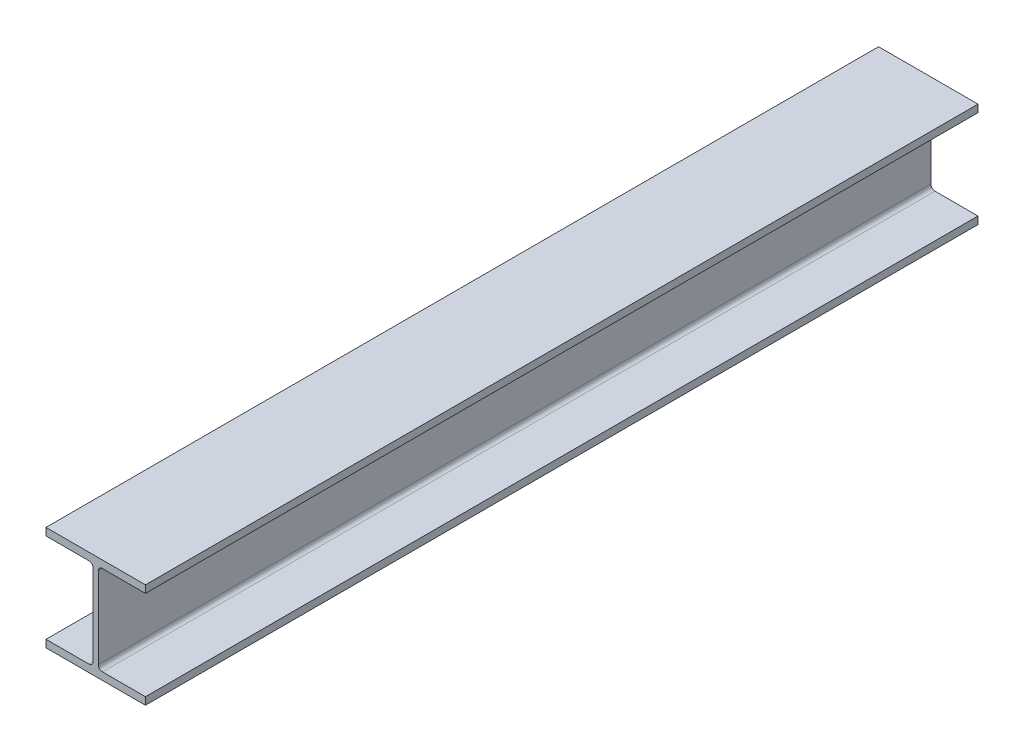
ISO-10303-21;
HEADER;
FILE_DESCRIPTION(('STEP AP214'),'2;1');
FILE_NAME('part.step','',(''),(''),'','','');
FILE_SCHEMA(('AUTOMOTIVE_DESIGN { 1 0 10303 214 1 1 1 1 }'));
ENDSEC;
DATA;
#1=APPLICATION_CONTEXT('core data for automotive mechanical design processes');
#2=APPLICATION_PROTOCOL_DEFINITION('international standard','automotive_design',2000,#1);
#3=PRODUCT_CONTEXT('',#1,'mechanical');
#4=PRODUCT('Part','Part','',(#3));
#5=PRODUCT_RELATED_PRODUCT_CATEGORY('part','',(#4));
#6=PRODUCT_DEFINITION_FORMATION('','',#4);
#7=PRODUCT_DEFINITION_CONTEXT('part definition',#1,'design');
#8=PRODUCT_DEFINITION('design','',#6,#7);
#9=PRODUCT_DEFINITION_SHAPE('','',#8);
#10=(LENGTH_UNIT() NAMED_UNIT(*) SI_UNIT(.MILLI.,.METRE.));
#11=(NAMED_UNIT(*) PLANE_ANGLE_UNIT() SI_UNIT($,.RADIAN.));
#12=(NAMED_UNIT(*) SI_UNIT($,.STERADIAN.) SOLID_ANGLE_UNIT());
#13=UNCERTAINTY_MEASURE_WITH_UNIT(LENGTH_MEASURE(1.E-05),#10,'distance_accuracy_value','');
#14=(GEOMETRIC_REPRESENTATION_CONTEXT(3) GLOBAL_UNCERTAINTY_ASSIGNED_CONTEXT((#13)) GLOBAL_UNIT_ASSIGNED_CONTEXT((#10,
#11,#12)) REPRESENTATION_CONTEXT('',''));
#15=CARTESIAN_POINT('',(0.,0.,0.));
#16=DIRECTION('',(0.,0.,1.));
#17=DIRECTION('',(1.,0.,0.));
#18=AXIS2_PLACEMENT_3D('',#15,#16,#17);
#19=CARTESIAN_POINT('',(154.432,0.,-646.51128));
#20=DIRECTION('',(0.,-1.,0.));
#21=DIRECTION('',(0.,0.,-1.));
#22=AXIS2_PLACEMENT_3D('',#19,#20,#21);
#23=PLANE('',#22);
#24=DIRECTION('',(1.,0.,0.));
#25=VECTOR('',#24,1.);
#26=CARTESIAN_POINT('',(154.432,0.,646.51128));
#27=LINE('',#26,#25);
#28=CARTESIAN_POINT('',(0.,0.,646.51128));
#29=VERTEX_POINT('',#28);
#30=CARTESIAN_POINT('',(154.432,0.,646.51128));
#31=VERTEX_POINT('',#30);
#32=EDGE_CURVE('E178',#29,#31,#27,.T.);
#33=ORIENTED_EDGE('',*,*,#32,.F.);
#34=DIRECTION('',(0.,0.,1.));
#35=VECTOR('',#34,1.);
#36=CARTESIAN_POINT('',(0.,0.,-646.51128));
#37=LINE('',#36,#35);
#38=CARTESIAN_POINT('',(0.,0.,-646.51128));
#39=VERTEX_POINT('',#38);
#40=EDGE_CURVE('E11',#39,#29,#37,.T.);
#41=ORIENTED_EDGE('',*,*,#40,.F.);
#42=DIRECTION('',(1.,0.,0.));
#43=VECTOR('',#42,1.);
#44=CARTESIAN_POINT('',(154.432,0.,-646.51128));
#45=LINE('',#44,#43);
#46=CARTESIAN_POINT('',(154.432,0.,-646.51128));
#47=VERTEX_POINT('',#46);
#48=EDGE_CURVE('E222',#39,#47,#45,.T.);
#49=ORIENTED_EDGE('',*,*,#48,.T.);
#50=DIRECTION('',(0.,0.,1.));
#51=VECTOR('',#50,1.);
#52=CARTESIAN_POINT('',(154.432,0.,-646.51128));
#53=LINE('',#52,#51);
#54=EDGE_CURVE('E36',#47,#31,#53,.T.);
#55=ORIENTED_EDGE('',*,*,#54,.T.);
#56=EDGE_LOOP('',(#33,#41,#49,#55));
#57=FACE_BOUND('',#56,.T.);
#58=ADVANCED_FACE('F33',(#57),#23,.T.);
#59=CARTESIAN_POINT('',(0.,0.,-646.51128));
#60=DIRECTION('',(-1.,0.,0.));
#61=DIRECTION('',(0.,-1.,0.));
#62=AXIS2_PLACEMENT_3D('',#59,#60,#61);
#63=PLANE('',#62);
#64=DIRECTION('',(0.,-1.,0.));
#65=VECTOR('',#64,1.);
#66=CARTESIAN_POINT('',(0.,0.,646.51128));
#67=LINE('',#66,#65);
#68=CARTESIAN_POINT('',(0.,11.557,646.51128));
#69=VERTEX_POINT('',#68);
#70=EDGE_CURVE('E220',#69,#29,#67,.T.);
#71=ORIENTED_EDGE('',*,*,#70,.F.);
#72=DIRECTION('',(0.,0.,1.));
#73=VECTOR('',#72,1.);
#74=CARTESIAN_POINT('',(0.,11.557,-646.51128));
#75=LINE('',#74,#73);
#76=CARTESIAN_POINT('',(0.,11.557,-646.51128));
#77=VERTEX_POINT('',#76);
#78=EDGE_CURVE('E42',#77,#69,#75,.T.);
#79=ORIENTED_EDGE('',*,*,#78,.F.);
#80=DIRECTION('',(0.,-1.,0.));
#81=VECTOR('',#80,1.);
#82=CARTESIAN_POINT('',(0.,0.,-646.51128));
#83=LINE('',#82,#81);
#84=EDGE_CURVE('E168',#77,#39,#83,.T.);
#85=ORIENTED_EDGE('',*,*,#84,.T.);
#86=ORIENTED_EDGE('',*,*,#40,.T.);
#87=EDGE_LOOP('',(#71,#79,#85,#86));
#88=FACE_BOUND('',#87,.T.);
#89=ADVANCED_FACE('F250',(#88),#63,.T.);
#90=CARTESIAN_POINT('',(0.,11.557,-646.51128));
#91=DIRECTION('',(0.,1.,0.));
#92=DIRECTION('',(-1.,0.,0.));
#93=AXIS2_PLACEMENT_3D('',#90,#91,#92);
#94=PLANE('',#93);
#95=DIRECTION('',(-1.,0.,0.));
#96=VECTOR('',#95,1.);
#97=CARTESIAN_POINT('',(0.,11.557,646.51128));
#98=LINE('',#97,#96);
#99=CARTESIAN_POINT('',(66.802,11.557,646.51128));
#100=VERTEX_POINT('',#99);
#101=EDGE_CURVE('E155',#100,#69,#98,.T.);
#102=ORIENTED_EDGE('',*,*,#101,.F.);
#103=DIRECTION('',(0.,0.,1.));
#104=VECTOR('',#103,1.);
#105=CARTESIAN_POINT('',(66.802,11.557,-646.51128));
#106=LINE('',#105,#104);
#107=CARTESIAN_POINT('',(66.802,11.557,-646.51128));
#108=VERTEX_POINT('',#107);
#109=EDGE_CURVE('E150',#108,#100,#106,.T.);
#110=ORIENTED_EDGE('',*,*,#109,.F.);
#111=DIRECTION('',(-1.,0.,0.));
#112=VECTOR('',#111,1.);
#113=CARTESIAN_POINT('',(0.,11.557,-646.51128));
#114=LINE('',#113,#112);
#115=EDGE_CURVE('E153',#108,#77,#114,.T.);
#116=ORIENTED_EDGE('',*,*,#115,.T.);
#117=ORIENTED_EDGE('',*,*,#78,.T.);
#118=EDGE_LOOP('',(#102,#110,#116,#117));
#119=FACE_BOUND('',#118,.T.);
#120=ADVANCED_FACE('F152',(#119),#94,.T.);
#121=CARTESIAN_POINT('',(66.802,17.907,-646.51128));
#122=DIRECTION('',(0.,0.,1.));
#123=DIRECTION('',(1.,0.,0.));
#124=AXIS2_PLACEMENT_3D('',#121,#122,#123);
#125=CYLINDRICAL_SURFACE('',#124,6.35);
#126=CARTESIAN_POINT('',(66.802,17.907,646.51128));
#127=DIRECTION('',(0.,0.,-1.));
#128=DIRECTION('',(1.,0.,0.));
#129=AXIS2_PLACEMENT_3D('',#126,#127,#128);
#130=CIRCLE('',#129,6.35);
#131=CARTESIAN_POINT('',(73.152,17.907,646.51128));
#132=VERTEX_POINT('',#131);
#133=EDGE_CURVE('E217',#132,#100,#130,.T.);
#134=ORIENTED_EDGE('',*,*,#133,.F.);
#135=DIRECTION('',(0.,0.,1.));
#136=VECTOR('',#135,1.);
#137=CARTESIAN_POINT('',(73.152,17.907,-646.51128));
#138=LINE('',#137,#136);
#139=CARTESIAN_POINT('',(73.152,17.907,-646.51128));
#140=VERTEX_POINT('',#139);
#141=EDGE_CURVE('E160',#140,#132,#138,.T.);
#142=ORIENTED_EDGE('',*,*,#141,.F.);
#143=CARTESIAN_POINT('',(66.802,17.907,-646.51128));
#144=DIRECTION('',(0.,0.,-1.));
#145=DIRECTION('',(1.,0.,0.));
#146=AXIS2_PLACEMENT_3D('',#143,#144,#145);
#147=CIRCLE('',#146,6.35);
#148=EDGE_CURVE('E166',#140,#108,#147,.T.);
#149=ORIENTED_EDGE('',*,*,#148,.T.);
#150=ORIENTED_EDGE('',*,*,#109,.T.);
#151=EDGE_LOOP('',(#134,#142,#149,#150));
#152=FACE_BOUND('',#151,.T.);
#153=ADVANCED_FACE('F170',(#152),#125,.F.);
#154=CARTESIAN_POINT('',(73.152,17.907,-646.51128));
#155=DIRECTION('',(-1.,0.,0.));
#156=DIRECTION('',(0.,-1.,0.));
#157=AXIS2_PLACEMENT_3D('',#154,#155,#156);
#158=PLANE('',#157);
#159=DIRECTION('',(0.,-1.,0.));
#160=VECTOR('',#159,1.);
#161=CARTESIAN_POINT('',(73.152,17.907,646.51128));
#162=LINE('',#161,#160);
#163=CARTESIAN_POINT('',(73.152,144.145,646.51128));
#164=VERTEX_POINT('',#163);
#165=EDGE_CURVE('E214',#164,#132,#162,.T.);
#166=ORIENTED_EDGE('',*,*,#165,.F.);
#167=DIRECTION('',(0.,0.,1.));
#168=VECTOR('',#167,1.);
#169=CARTESIAN_POINT('',(73.152,144.145,-646.51128));
#170=LINE('',#169,#168);
#171=CARTESIAN_POINT('',(73.152,144.145,-646.51128));
#172=VERTEX_POINT('',#171);
#173=EDGE_CURVE('E226',#172,#164,#170,.T.);
#174=ORIENTED_EDGE('',*,*,#173,.F.);
#175=DIRECTION('',(0.,-1.,0.));
#176=VECTOR('',#175,1.);
#177=CARTESIAN_POINT('',(73.152,17.907,-646.51128));
#178=LINE('',#177,#176);
#179=EDGE_CURVE('E171',#172,#140,#178,.T.);
#180=ORIENTED_EDGE('',*,*,#179,.T.);
#181=ORIENTED_EDGE('',*,*,#141,.T.);
#182=EDGE_LOOP('',(#166,#174,#180,#181));
#183=FACE_BOUND('',#182,.T.);
#184=ADVANCED_FACE('F263',(#183),#158,.T.);
#185=CARTESIAN_POINT('',(66.802,144.145,-646.51128));
#186=DIRECTION('',(0.,0.,1.));
#187=DIRECTION('',(1.,0.,0.));
#188=AXIS2_PLACEMENT_3D('',#185,#186,#187);
#189=CYLINDRICAL_SURFACE('',#188,6.34999999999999);
#190=CARTESIAN_POINT('',(66.802,144.145,646.51128));
#191=DIRECTION('',(0.,0.,-1.));
#192=DIRECTION('',(1.,0.,0.));
#193=AXIS2_PLACEMENT_3D('',#190,#191,#192);
#194=CIRCLE('',#193,6.34999999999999);
#195=CARTESIAN_POINT('',(66.802,150.495,646.51128));
#196=VERTEX_POINT('',#195);
#197=EDGE_CURVE('E211',#196,#164,#194,.T.);
#198=ORIENTED_EDGE('',*,*,#197,.F.);
#199=DIRECTION('',(0.,0.,1.));
#200=VECTOR('',#199,1.);
#201=CARTESIAN_POINT('',(66.802,150.495,-646.51128));
#202=LINE('',#201,#200);
#203=CARTESIAN_POINT('',(66.802,150.495,-646.51128));
#204=VERTEX_POINT('',#203);
#205=EDGE_CURVE('E228',#204,#196,#202,.T.);
#206=ORIENTED_EDGE('',*,*,#205,.F.);
#207=CARTESIAN_POINT('',(66.802,144.145,-646.51128));
#208=DIRECTION('',(0.,0.,-1.));
#209=DIRECTION('',(1.,0.,0.));
#210=AXIS2_PLACEMENT_3D('',#207,#208,#209);
#211=CIRCLE('',#210,6.34999999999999);
#212=EDGE_CURVE('E173',#204,#172,#211,.T.);
#213=ORIENTED_EDGE('',*,*,#212,.T.);
#214=ORIENTED_EDGE('',*,*,#173,.T.);
#215=EDGE_LOOP('',(#198,#206,#213,#214));
#216=FACE_BOUND('',#215,.T.);
#217=ADVANCED_FACE('F266',(#216),#189,.F.);
#218=CARTESIAN_POINT('',(66.802,150.495,-646.51128));
#219=DIRECTION('',(0.,-1.,0.));
#220=DIRECTION('',(0.,0.,-1.));
#221=AXIS2_PLACEMENT_3D('',#218,#219,#220);
#222=PLANE('',#221);
#223=DIRECTION('',(1.,0.,0.));
#224=VECTOR('',#223,1.);
#225=CARTESIAN_POINT('',(66.802,150.495,646.51128));
#226=LINE('',#225,#224);
#227=CARTESIAN_POINT('',(0.,150.495,646.51128));
#228=VERTEX_POINT('',#227);
#229=EDGE_CURVE('E208',#228,#196,#226,.T.);
#230=ORIENTED_EDGE('',*,*,#229,.F.);
#231=DIRECTION('',(0.,0.,1.));
#232=VECTOR('',#231,1.);
#233=CARTESIAN_POINT('',(0.,150.495,-646.51128));
#234=LINE('',#233,#232);
#235=CARTESIAN_POINT('',(0.,150.495,-646.51128));
#236=VERTEX_POINT('',#235);
#237=EDGE_CURVE('E230',#236,#228,#234,.T.);
#238=ORIENTED_EDGE('',*,*,#237,.F.);
#239=DIRECTION('',(1.,0.,0.));
#240=VECTOR('',#239,1.);
#241=CARTESIAN_POINT('',(66.802,150.495,-646.51128));
#242=LINE('',#241,#240);
#243=EDGE_CURVE('E447',#236,#204,#242,.T.);
#244=ORIENTED_EDGE('',*,*,#243,.T.);
#245=ORIENTED_EDGE('',*,*,#205,.T.);
#246=EDGE_LOOP('',(#230,#238,#244,#245));
#247=FACE_BOUND('',#246,.T.);
#248=ADVANCED_FACE('F270',(#247),#222,.T.);
#249=CARTESIAN_POINT('',(0.,150.495,-646.51128));
#250=DIRECTION('',(-1.,0.,0.));
#251=DIRECTION('',(0.,-1.,0.));
#252=AXIS2_PLACEMENT_3D('',#249,#250,#251);
#253=PLANE('',#252);
#254=DIRECTION('',(0.,-1.,0.));
#255=VECTOR('',#254,1.);
#256=CARTESIAN_POINT('',(0.,150.495,646.51128));
#257=LINE('',#256,#255);
#258=CARTESIAN_POINT('',(0.,162.052,646.51128));
#259=VERTEX_POINT('',#258);
#260=EDGE_CURVE('E205',#259,#228,#257,.T.);
#261=ORIENTED_EDGE('',*,*,#260,.F.);
#262=DIRECTION('',(0.,0.,1.));
#263=VECTOR('',#262,1.);
#264=CARTESIAN_POINT('',(0.,162.052,-646.51128));
#265=LINE('',#264,#263);
#266=CARTESIAN_POINT('',(0.,162.052,-646.51128));
#267=VERTEX_POINT('',#266);
#268=EDGE_CURVE('E232',#267,#259,#265,.T.);
#269=ORIENTED_EDGE('',*,*,#268,.F.);
#270=DIRECTION('',(0.,-1.,0.));
#271=VECTOR('',#270,1.);
#272=CARTESIAN_POINT('',(0.,150.495,-646.51128));
#273=LINE('',#272,#271);
#274=EDGE_CURVE('E443',#267,#236,#273,.T.);
#275=ORIENTED_EDGE('',*,*,#274,.T.);
#276=ORIENTED_EDGE('',*,*,#237,.T.);
#277=EDGE_LOOP('',(#261,#269,#275,#276));
#278=FACE_BOUND('',#277,.T.);
#279=ADVANCED_FACE('F274',(#278),#253,.T.);
#280=CARTESIAN_POINT('',(0.,162.052,-646.51128));
#281=DIRECTION('',(0.,1.,0.));
#282=DIRECTION('',(0.,0.,1.));
#283=AXIS2_PLACEMENT_3D('',#280,#281,#282);
#284=PLANE('',#283);
#285=DIRECTION('',(-1.,0.,0.));
#286=VECTOR('',#285,1.);
#287=CARTESIAN_POINT('',(0.,162.052,646.51128));
#288=LINE('',#287,#286);
#289=CARTESIAN_POINT('',(154.432,162.052,646.51128));
#290=VERTEX_POINT('',#289);
#291=EDGE_CURVE('E202',#290,#259,#288,.T.);
#292=ORIENTED_EDGE('',*,*,#291,.F.);
#293=DIRECTION('',(0.,0.,1.));
#294=VECTOR('',#293,1.);
#295=CARTESIAN_POINT('',(154.432,162.052,-646.51128));
#296=LINE('',#295,#294);
#297=CARTESIAN_POINT('',(154.432,162.052,-646.51128));
#298=VERTEX_POINT('',#297);
#299=EDGE_CURVE('E234',#298,#290,#296,.T.);
#300=ORIENTED_EDGE('',*,*,#299,.F.);
#301=DIRECTION('',(-1.,0.,0.));
#302=VECTOR('',#301,1.);
#303=CARTESIAN_POINT('',(0.,162.052,-646.51128));
#304=LINE('',#303,#302);
#305=EDGE_CURVE('E454',#298,#267,#304,.T.);
#306=ORIENTED_EDGE('',*,*,#305,.T.);
#307=ORIENTED_EDGE('',*,*,#268,.T.);
#308=EDGE_LOOP('',(#292,#300,#306,#307));
#309=FACE_BOUND('',#308,.T.);
#310=ADVANCED_FACE('F278',(#309),#284,.T.);
#311=CARTESIAN_POINT('',(154.432,162.052,-646.51128));
#312=DIRECTION('',(1.,0.,0.));
#313=DIRECTION('',(0.,0.,-1.));
#314=AXIS2_PLACEMENT_3D('',#311,#312,#313);
#315=PLANE('',#314);
#316=DIRECTION('',(0.,1.,0.));
#317=VECTOR('',#316,1.);
#318=CARTESIAN_POINT('',(154.432,162.052,646.51128));
#319=LINE('',#318,#317);
#320=CARTESIAN_POINT('',(154.432,150.495,646.51128));
#321=VERTEX_POINT('',#320);
#322=EDGE_CURVE('E199',#321,#290,#319,.T.);
#323=ORIENTED_EDGE('',*,*,#322,.F.);
#324=DIRECTION('',(0.,0.,1.));
#325=VECTOR('',#324,1.);
#326=CARTESIAN_POINT('',(154.432,150.495,-646.51128));
#327=LINE('',#326,#325);
#328=CARTESIAN_POINT('',(154.432,150.495,-646.51128));
#329=VERTEX_POINT('',#328);
#330=EDGE_CURVE('E236',#329,#321,#327,.T.);
#331=ORIENTED_EDGE('',*,*,#330,.F.);
#332=DIRECTION('',(0.,1.,0.));
#333=VECTOR('',#332,1.);
#334=CARTESIAN_POINT('',(154.432,162.052,-646.51128));
#335=LINE('',#334,#333);
#336=EDGE_CURVE('E436',#329,#298,#335,.T.);
#337=ORIENTED_EDGE('',*,*,#336,.T.);
#338=ORIENTED_EDGE('',*,*,#299,.T.);
#339=EDGE_LOOP('',(#323,#331,#337,#338));
#340=FACE_BOUND('',#339,.T.);
#341=ADVANCED_FACE('F282',(#340),#315,.T.);
#342=CARTESIAN_POINT('',(154.432,150.495,-646.51128));
#343=DIRECTION('',(0.,-1.,0.));
#344=DIRECTION('',(0.,0.,-1.));
#345=AXIS2_PLACEMENT_3D('',#342,#343,#344);
#346=PLANE('',#345);
#347=DIRECTION('',(1.,0.,0.));
#348=VECTOR('',#347,1.);
#349=CARTESIAN_POINT('',(154.432,150.495,646.51128));
#350=LINE('',#349,#348);
#351=CARTESIAN_POINT('',(87.63,150.495,646.51128));
#352=VERTEX_POINT('',#351);
#353=EDGE_CURVE('E196',#352,#321,#350,.T.);
#354=ORIENTED_EDGE('',*,*,#353,.F.);
#355=DIRECTION('',(0.,0.,1.));
#356=VECTOR('',#355,1.);
#357=CARTESIAN_POINT('',(87.63,150.495,-646.51128));
#358=LINE('',#357,#356);
#359=CARTESIAN_POINT('',(87.63,150.495,-646.51128));
#360=VERTEX_POINT('',#359);
#361=EDGE_CURVE('E238',#360,#352,#358,.T.);
#362=ORIENTED_EDGE('',*,*,#361,.F.);
#363=DIRECTION('',(1.,0.,0.));
#364=VECTOR('',#363,1.);
#365=CARTESIAN_POINT('',(154.432,150.495,-646.51128));
#366=LINE('',#365,#364);
#367=EDGE_CURVE('E432',#360,#329,#366,.T.);
#368=ORIENTED_EDGE('',*,*,#367,.T.);
#369=ORIENTED_EDGE('',*,*,#330,.T.);
#370=EDGE_LOOP('',(#354,#362,#368,#369));
#371=FACE_BOUND('',#370,.T.);
#372=ADVANCED_FACE('F286',(#371),#346,.T.);
#373=CARTESIAN_POINT('',(87.63,144.145,-646.51128));
#374=DIRECTION('',(0.,0.,1.));
#375=DIRECTION('',(1.,0.,0.));
#376=AXIS2_PLACEMENT_3D('',#373,#374,#375);
#377=CYLINDRICAL_SURFACE('',#376,6.34999999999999);
#378=CARTESIAN_POINT('',(87.63,144.145,646.51128));
#379=DIRECTION('',(0.,0.,-1.));
#380=DIRECTION('',(1.,0.,0.));
#381=AXIS2_PLACEMENT_3D('',#378,#379,#380);
#382=CIRCLE('',#381,6.34999999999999);
#383=CARTESIAN_POINT('',(81.28,144.145,646.51128));
#384=VERTEX_POINT('',#383);
#385=EDGE_CURVE('E193',#384,#352,#382,.T.);
#386=ORIENTED_EDGE('',*,*,#385,.F.);
#387=DIRECTION('',(0.,0.,1.));
#388=VECTOR('',#387,1.);
#389=CARTESIAN_POINT('',(81.28,144.145,-646.51128));
#390=LINE('',#389,#388);
#391=CARTESIAN_POINT('',(81.28,144.145,-646.51128));
#392=VERTEX_POINT('',#391);
#393=EDGE_CURVE('E240',#392,#384,#390,.T.);
#394=ORIENTED_EDGE('',*,*,#393,.F.);
#395=CARTESIAN_POINT('',(87.63,144.145,-646.51128));
#396=DIRECTION('',(0.,0.,-1.));
#397=DIRECTION('',(1.,0.,0.));
#398=AXIS2_PLACEMENT_3D('',#395,#396,#397);
#399=CIRCLE('',#398,6.34999999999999);
#400=EDGE_CURVE('E458',#392,#360,#399,.T.);
#401=ORIENTED_EDGE('',*,*,#400,.T.);
#402=ORIENTED_EDGE('',*,*,#361,.T.);
#403=EDGE_LOOP('',(#386,#394,#401,#402));
#404=FACE_BOUND('',#403,.T.);
#405=ADVANCED_FACE('F290',(#404),#377,.F.);
#406=CARTESIAN_POINT('',(81.28,144.145,-646.51128));
#407=DIRECTION('',(1.,0.,0.));
#408=DIRECTION('',(0.,1.,0.));
#409=AXIS2_PLACEMENT_3D('',#406,#407,#408);
#410=PLANE('',#409);
#411=DIRECTION('',(0.,1.,0.));
#412=VECTOR('',#411,1.);
#413=CARTESIAN_POINT('',(81.28,144.145,646.51128));
#414=LINE('',#413,#412);
#415=CARTESIAN_POINT('',(81.28,17.907,646.51128));
#416=VERTEX_POINT('',#415);
#417=EDGE_CURVE('E190',#416,#384,#414,.T.);
#418=ORIENTED_EDGE('',*,*,#417,.F.);
#419=DIRECTION('',(0.,0.,1.));
#420=VECTOR('',#419,1.);
#421=CARTESIAN_POINT('',(81.28,17.907,-646.51128));
#422=LINE('',#421,#420);
#423=CARTESIAN_POINT('',(81.28,17.907,-646.51128));
#424=VERTEX_POINT('',#423);
#425=EDGE_CURVE('E242',#424,#416,#422,.T.);
#426=ORIENTED_EDGE('',*,*,#425,.F.);
#427=DIRECTION('',(0.,1.,0.));
#428=VECTOR('',#427,1.);
#429=CARTESIAN_POINT('',(81.28,144.145,-646.51128));
#430=LINE('',#429,#428);
#431=EDGE_CURVE('E425',#424,#392,#430,.T.);
#432=ORIENTED_EDGE('',*,*,#431,.T.);
#433=ORIENTED_EDGE('',*,*,#393,.T.);
#434=EDGE_LOOP('',(#418,#426,#432,#433));
#435=FACE_BOUND('',#434,.T.);
#436=ADVANCED_FACE('F294',(#435),#410,.T.);
#437=CARTESIAN_POINT('',(87.63,17.907,-646.51128));
#438=DIRECTION('',(0.,0.,1.));
#439=DIRECTION('',(1.,0.,0.));
#440=AXIS2_PLACEMENT_3D('',#437,#438,#439);
#441=CYLINDRICAL_SURFACE('',#440,6.34999999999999);
#442=CARTESIAN_POINT('',(87.63,17.907,646.51128));
#443=DIRECTION('',(0.,0.,-1.));
#444=DIRECTION('',(1.,0.,0.));
#445=AXIS2_PLACEMENT_3D('',#442,#443,#444);
#446=CIRCLE('',#445,6.34999999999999);
#447=CARTESIAN_POINT('',(87.63,11.557,646.51128));
#448=VERTEX_POINT('',#447);
#449=EDGE_CURVE('E187',#448,#416,#446,.T.);
#450=ORIENTED_EDGE('',*,*,#449,.F.);
#451=DIRECTION('',(0.,0.,1.));
#452=VECTOR('',#451,1.);
#453=CARTESIAN_POINT('',(87.63,11.557,-646.51128));
#454=LINE('',#453,#452);
#455=CARTESIAN_POINT('',(87.63,11.557,-646.51128));
#456=VERTEX_POINT('',#455);
#457=EDGE_CURVE('E244',#456,#448,#454,.T.);
#458=ORIENTED_EDGE('',*,*,#457,.F.);
#459=CARTESIAN_POINT('',(87.63,17.907,-646.51128));
#460=DIRECTION('',(0.,0.,-1.));
#461=DIRECTION('',(1.,0.,0.));
#462=AXIS2_PLACEMENT_3D('',#459,#460,#461);
#463=CIRCLE('',#462,6.34999999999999);
#464=EDGE_CURVE('E421',#456,#424,#463,.T.);
#465=ORIENTED_EDGE('',*,*,#464,.T.);
#466=ORIENTED_EDGE('',*,*,#425,.T.);
#467=EDGE_LOOP('',(#450,#458,#465,#466));
#468=FACE_BOUND('',#467,.T.);
#469=ADVANCED_FACE('F298',(#468),#441,.F.);
#470=CARTESIAN_POINT('',(87.63,11.557,-646.51128));
#471=DIRECTION('',(0.,1.,0.));
#472=DIRECTION('',(-1.,0.,0.));
#473=AXIS2_PLACEMENT_3D('',#470,#471,#472);
#474=PLANE('',#473);
#475=DIRECTION('',(-1.,0.,0.));
#476=VECTOR('',#475,1.);
#477=CARTESIAN_POINT('',(87.63,11.557,646.51128));
#478=LINE('',#477,#476);
#479=CARTESIAN_POINT('',(154.432,11.557,646.51128));
#480=VERTEX_POINT('',#479);
#481=EDGE_CURVE('E184',#480,#448,#478,.T.);
#482=ORIENTED_EDGE('',*,*,#481,.F.);
#483=DIRECTION('',(0.,0.,1.));
#484=VECTOR('',#483,1.);
#485=CARTESIAN_POINT('',(154.432,11.557,-646.51128));
#486=LINE('',#485,#484);
#487=CARTESIAN_POINT('',(154.432,11.557,-646.51128));
#488=VERTEX_POINT('',#487);
#489=EDGE_CURVE('E245',#488,#480,#486,.T.);
#490=ORIENTED_EDGE('',*,*,#489,.F.);
#491=DIRECTION('',(-1.,0.,0.));
#492=VECTOR('',#491,1.);
#493=CARTESIAN_POINT('',(87.63,11.557,-646.51128));
#494=LINE('',#493,#492);
#495=EDGE_CURVE('E462',#488,#456,#494,.T.);
#496=ORIENTED_EDGE('',*,*,#495,.T.);
#497=ORIENTED_EDGE('',*,*,#457,.T.);
#498=EDGE_LOOP('',(#482,#490,#496,#497));
#499=FACE_BOUND('',#498,.T.);
#500=ADVANCED_FACE('F302',(#499),#474,.T.);
#501=CARTESIAN_POINT('',(154.432,11.557,-646.51128));
#502=DIRECTION('',(1.,0.,0.));
#503=DIRECTION('',(0.,0.,-1.));
#504=AXIS2_PLACEMENT_3D('',#501,#502,#503);
#505=PLANE('',#504);
#506=DIRECTION('',(0.,1.,0.));
#507=VECTOR('',#506,1.);
#508=CARTESIAN_POINT('',(154.432,11.557,646.51128));
#509=LINE('',#508,#507);
#510=EDGE_CURVE('E181',#31,#480,#509,.T.);
#511=ORIENTED_EDGE('',*,*,#510,.F.);
#512=ORIENTED_EDGE('',*,*,#54,.F.);
#513=DIRECTION('',(0.,1.,0.));
#514=VECTOR('',#513,1.);
#515=CARTESIAN_POINT('',(154.432,11.557,-646.51128));
#516=LINE('',#515,#514);
#517=EDGE_CURVE('E464',#47,#488,#516,.T.);
#518=ORIENTED_EDGE('',*,*,#517,.T.);
#519=ORIENTED_EDGE('',*,*,#489,.T.);
#520=EDGE_LOOP('',(#511,#512,#518,#519));
#521=FACE_BOUND('',#520,.T.);
#522=ADVANCED_FACE('F247',(#521),#505,.T.);
#523=CARTESIAN_POINT('',(66.802,17.907,-646.51128));
#524=DIRECTION('',(0.,0.,1.));
#525=DIRECTION('',(1.,0.,0.));
#526=AXIS2_PLACEMENT_3D('',#523,#524,#525);
#527=PLANE('',#526);
#528=ORIENTED_EDGE('',*,*,#48,.F.);
#529=ORIENTED_EDGE('',*,*,#84,.F.);
#530=ORIENTED_EDGE('',*,*,#115,.F.);
#531=ORIENTED_EDGE('',*,*,#148,.F.);
#532=ORIENTED_EDGE('',*,*,#179,.F.);
#533=ORIENTED_EDGE('',*,*,#212,.F.);
#534=ORIENTED_EDGE('',*,*,#243,.F.);
#535=ORIENTED_EDGE('',*,*,#274,.F.);
#536=ORIENTED_EDGE('',*,*,#305,.F.);
#537=ORIENTED_EDGE('',*,*,#336,.F.);
#538=ORIENTED_EDGE('',*,*,#367,.F.);
#539=ORIENTED_EDGE('',*,*,#400,.F.);
#540=ORIENTED_EDGE('',*,*,#431,.F.);
#541=ORIENTED_EDGE('',*,*,#464,.F.);
#542=ORIENTED_EDGE('',*,*,#495,.F.);
#543=ORIENTED_EDGE('',*,*,#517,.F.);
#544=EDGE_LOOP('',(#528,#529,#530,#531,#532,#533,#534,#535,#536,#537,#538,#539,#540,#541,#542,#543));
#545=FACE_BOUND('',#544,.T.);
#546=ADVANCED_FACE('F164',(#545),#527,.F.);
#547=CARTESIAN_POINT('',(66.802,17.907,646.51128));
#548=DIRECTION('',(0.,0.,1.));
#549=DIRECTION('',(1.,0.,0.));
#550=AXIS2_PLACEMENT_3D('',#547,#548,#549);
#551=PLANE('',#550);
#552=ORIENTED_EDGE('',*,*,#32,.T.);
#553=ORIENTED_EDGE('',*,*,#510,.T.);
#554=ORIENTED_EDGE('',*,*,#481,.T.);
#555=ORIENTED_EDGE('',*,*,#449,.T.);
#556=ORIENTED_EDGE('',*,*,#417,.T.);
#557=ORIENTED_EDGE('',*,*,#385,.T.);
#558=ORIENTED_EDGE('',*,*,#353,.T.);
#559=ORIENTED_EDGE('',*,*,#322,.T.);
#560=ORIENTED_EDGE('',*,*,#291,.T.);
#561=ORIENTED_EDGE('',*,*,#260,.T.);
#562=ORIENTED_EDGE('',*,*,#229,.T.);
#563=ORIENTED_EDGE('',*,*,#197,.T.);
#564=ORIENTED_EDGE('',*,*,#165,.T.);
#565=ORIENTED_EDGE('',*,*,#133,.T.);
#566=ORIENTED_EDGE('',*,*,#101,.T.);
#567=ORIENTED_EDGE('',*,*,#70,.T.);
#568=EDGE_LOOP('',(#552,#553,#554,#555,#556,#557,#558,#559,#560,#561,#562,#563,#564,#565,#566,#567));
#569=FACE_BOUND('',#568,.T.);
#570=ADVANCED_FACE('F249',(#569),#551,.T.);
#571=CLOSED_SHELL('',(#58,#89,#120,#153,#184,#217,#248,#279,#310,#341,#372,#405,#436,#469,#500,
#522,#546,#570));
#572=MANIFOLD_SOLID_BREP('B2',#571);
#573=ADVANCED_BREP_SHAPE_REPRESENTATION('',(#18,#572),#14);
#574=SHAPE_DEFINITION_REPRESENTATION(#9,#573);
ENDSEC;
END-ISO-10303-21;
